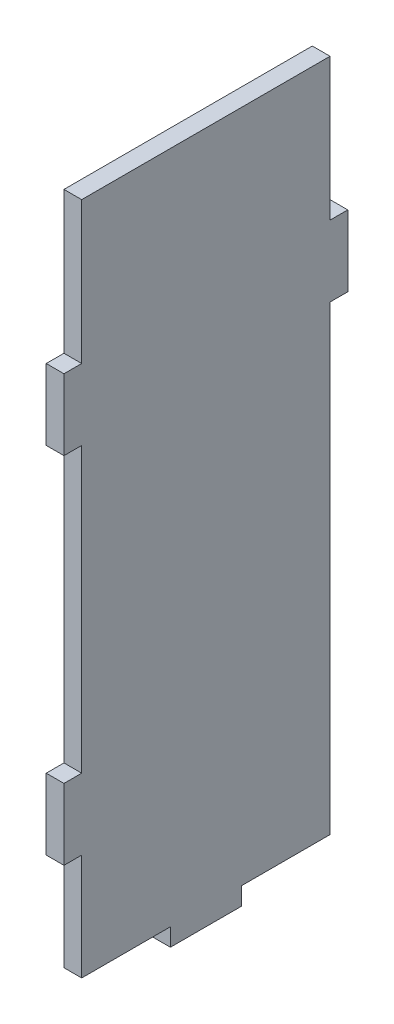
from build123d import *

# Parameters (mm, degrees)
SKETCH1_W           = 44.45
SKETCH1_H           = 127
BOSS_EXTRUDE1_DEPTH = 1.5875
SKETCH2_W           = 3.175
SKETCH2_H           = 12.7
BOSS_EXTRUDE2_DEPTH = 3.175
CUT_EXTRUDE1_DEPTH  = 69.465251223
SKETCH4_W           = 3.175
SKETCH4_H           = 12.7
CUT_EXTRUDE2_DEPTH  = 69.465251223


with BuildPart() as part:
    # Sketch1 → Boss-Extrude1 (new, symmetric)
    with BuildSketch(Plane(origin=(0, 0, 0), x_dir=(0, 0, -1), z_dir=(1, 0, 0))):
        Rectangle(SKETCH1_W, SKETCH1_H)
    extrude(amount=BOSS_EXTRUDE1_DEPTH, both=True)

    # Sketch2 → Boss-Extrude2 (add)
    with BuildSketch(Plane(origin=(1.5875, 0, 0), x_dir=(0, 0, -1), z_dir=(1, 0, 0))):
        with Locations((-23.8125, 31.75)):
            Rectangle(SKETCH2_W, SKETCH2_H)
        with Locations((-23.8125, -31.75)):
            Rectangle(SKETCH2_W, SKETCH2_H)
    boss_extrude2 = extrude(amount=-BOSS_EXTRUDE2_DEPTH)

    # Mirror1: Boss-Extrude2 across plane
    add(boss_extrude2.mirror(Plane.XY))

    # Sketch3 → Cut-Extrude1 (cut, through all)
    with BuildSketch(Plane(origin=(1.5875, 0, 0), x_dir=(0, 0, -1), z_dir=(1, 0, 0))):
        Polygon((-6.35, -60.325), (6.35, -60.325), (6.35, -57.15), (22.225, -57.15), (22.225, -63.5), (-22.225, -63.5), (-22.225, -57.15), (-6.35, -57.15), align=None)
    extrude(amount=-CUT_EXTRUDE1_DEPTH, mode=Mode.SUBTRACT)

    # Sketch4 → Cut-Extrude2 (cut, through all)
    with BuildSketch(Plane(origin=(1.5875, 0, 0), x_dir=(0, 0, -1), z_dir=(1, 0, 0))):
        with Locations((23.8125, -31.75)):
            Rectangle(SKETCH4_W, SKETCH4_H)
    extrude(amount=-CUT_EXTRUDE2_DEPTH, mode=Mode.SUBTRACT)


solid = part.part
